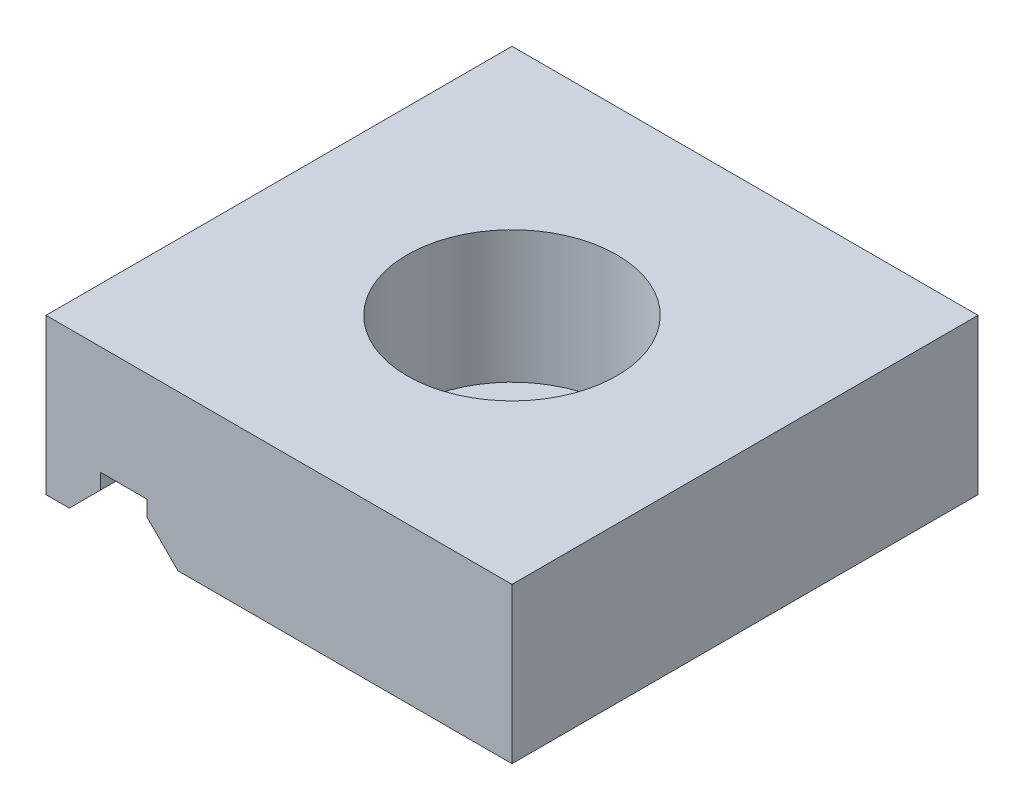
ISO-10303-21;
HEADER;
FILE_DESCRIPTION(('STEP AP214'),'2;1');
FILE_NAME('part.step','',(''),(''),'','','');
FILE_SCHEMA(('AUTOMOTIVE_DESIGN { 1 0 10303 214 1 1 1 1 }'));
ENDSEC;
DATA;
#1=APPLICATION_CONTEXT('core data for automotive mechanical design processes');
#2=APPLICATION_PROTOCOL_DEFINITION('international standard','automotive_design',2000,#1);
#3=PRODUCT_CONTEXT('',#1,'mechanical');
#4=PRODUCT('Part','Part','',(#3));
#5=PRODUCT_RELATED_PRODUCT_CATEGORY('part','',(#4));
#6=PRODUCT_DEFINITION_FORMATION('','',#4);
#7=PRODUCT_DEFINITION_CONTEXT('part definition',#1,'design');
#8=PRODUCT_DEFINITION('design','',#6,#7);
#9=PRODUCT_DEFINITION_SHAPE('','',#8);
#10=(LENGTH_UNIT() NAMED_UNIT(*) SI_UNIT(.MILLI.,.METRE.));
#11=(NAMED_UNIT(*) PLANE_ANGLE_UNIT() SI_UNIT($,.RADIAN.));
#12=(NAMED_UNIT(*) SI_UNIT($,.STERADIAN.) SOLID_ANGLE_UNIT());
#13=UNCERTAINTY_MEASURE_WITH_UNIT(LENGTH_MEASURE(1.E-05),#10,'distance_accuracy_value','');
#14=(GEOMETRIC_REPRESENTATION_CONTEXT(3) GLOBAL_UNCERTAINTY_ASSIGNED_CONTEXT((#13)) GLOBAL_UNIT_ASSIGNED_CONTEXT((#10,
#11,#12)) REPRESENTATION_CONTEXT('',''));
#15=CARTESIAN_POINT('',(0.,0.,0.));
#16=DIRECTION('',(0.,0.,1.));
#17=DIRECTION('',(1.,0.,0.));
#18=AXIS2_PLACEMENT_3D('',#15,#16,#17);
#19=CARTESIAN_POINT('',(15.,0.,-15.));
#20=DIRECTION('',(0.,-1.,0.));
#21=DIRECTION('',(0.,0.,-1.));
#22=AXIS2_PLACEMENT_3D('',#19,#20,#21);
#23=PLANE('',#22);
#24=CARTESIAN_POINT('',(0.,0.,0.));
#25=DIRECTION('',(0.,-1.,0.));
#26=DIRECTION('',(0.,0.,-1.));
#27=AXIS2_PLACEMENT_3D('',#24,#25,#26);
#28=CIRCLE('',#27,7.47725);
#29=CARTESIAN_POINT('',(-5.02275,0.,-5.53906580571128));
#30=VERTEX_POINT('',#29);
#31=CARTESIAN_POINT('',(-5.02275,0.,5.53906580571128));
#32=VERTEX_POINT('',#31);
#33=EDGE_CURVE('E201',#30,#32,#28,.T.);
#34=ORIENTED_EDGE('',*,*,#33,.F.);
#35=DIRECTION('',(0.,0.,1.));
#36=VECTOR('',#35,1.);
#37=CARTESIAN_POINT('',(-5.02275,0.,-15.));
#38=LINE('',#37,#36);
#39=EDGE_CURVE('E175',#30,#32,#38,.T.);
#40=ORIENTED_EDGE('',*,*,#39,.T.);
#41=EDGE_LOOP('',(#34,#40));
#42=FACE_BOUND('',#41,.T.);
#43=DIRECTION('',(0.,0.,1.));
#44=VECTOR('',#43,1.);
#45=CARTESIAN_POINT('',(-6.5,0.,-15.));
#46=LINE('',#45,#44);
#47=CARTESIAN_POINT('',(-6.5,0.,-15.));
#48=VERTEX_POINT('',#47);
#49=CARTESIAN_POINT('',(-6.5,0.,15.));
#50=VERTEX_POINT('',#49);
#51=EDGE_CURVE('E148',#48,#50,#46,.T.);
#52=ORIENTED_EDGE('',*,*,#51,.F.);
#53=DIRECTION('',(-1.,0.,0.));
#54=VECTOR('',#53,1.);
#55=CARTESIAN_POINT('',(-15.,0.,-15.));
#56=LINE('',#55,#54);
#57=CARTESIAN_POINT('',(15.,0.,-15.));
#58=VERTEX_POINT('',#57);
#59=EDGE_CURVE('E219',#58,#48,#56,.T.);
#60=ORIENTED_EDGE('',*,*,#59,.F.);
#61=DIRECTION('',(0.,0.,-1.));
#62=VECTOR('',#61,1.);
#63=CARTESIAN_POINT('',(15.,0.,15.));
#64=LINE('',#63,#62);
#65=CARTESIAN_POINT('',(15.,0.,15.));
#66=VERTEX_POINT('',#65);
#67=EDGE_CURVE('E205',#66,#58,#64,.T.);
#68=ORIENTED_EDGE('',*,*,#67,.F.);
#69=DIRECTION('',(1.,0.,0.));
#70=VECTOR('',#69,1.);
#71=CARTESIAN_POINT('',(-15.,0.,15.));
#72=LINE('',#71,#70);
#73=EDGE_CURVE('E77',#50,#66,#72,.T.);
#74=ORIENTED_EDGE('',*,*,#73,.F.);
#75=EDGE_LOOP('',(#52,#60,#68,#74));
#76=FACE_BOUND('',#75,.T.);
#77=ADVANCED_FACE('F33',(#42,#76),#23,.T.);
#78=DIRECTION('',(0.,0.,1.));
#79=VECTOR('',#78,1.);
#80=CARTESIAN_POINT('',(-13.5,0.,-15.));
#81=LINE('',#80,#79);
#82=CARTESIAN_POINT('',(-13.5,0.,-15.));
#83=VERTEX_POINT('',#82);
#84=CARTESIAN_POINT('',(-13.5,0.,15.));
#85=VERTEX_POINT('',#84);
#86=EDGE_CURVE('E178',#83,#85,#81,.T.);
#87=ORIENTED_EDGE('',*,*,#86,.T.);
#88=CARTESIAN_POINT('',(-15.,0.,15.));
#89=VERTEX_POINT('',#88);
#90=EDGE_CURVE('E210',#89,#85,#72,.T.);
#91=ORIENTED_EDGE('',*,*,#90,.F.);
#92=DIRECTION('',(0.,0.,1.));
#93=VECTOR('',#92,1.);
#94=CARTESIAN_POINT('',(-15.,0.,15.));
#95=LINE('',#94,#93);
#96=CARTESIAN_POINT('',(-15.,0.,-15.));
#97=VERTEX_POINT('',#96);
#98=EDGE_CURVE('E221',#97,#89,#95,.T.);
#99=ORIENTED_EDGE('',*,*,#98,.F.);
#100=EDGE_CURVE('E218',#83,#97,#56,.T.);
#101=ORIENTED_EDGE('',*,*,#100,.F.);
#102=EDGE_LOOP('',(#87,#91,#99,#101));
#103=FACE_BOUND('',#102,.T.);
#104=ADVANCED_FACE('F250',(#103),#23,.T.);
#105=CARTESIAN_POINT('',(15.,10.,15.));
#106=DIRECTION('',(-1.,0.,0.));
#107=DIRECTION('',(0.,0.,1.));
#108=AXIS2_PLACEMENT_3D('',#105,#106,#107);
#109=PLANE('',#108);
#110=ORIENTED_EDGE('',*,*,#67,.T.);
#111=DIRECTION('',(0.,-1.,0.));
#112=VECTOR('',#111,1.);
#113=CARTESIAN_POINT('',(15.,10.,-15.));
#114=LINE('',#113,#112);
#115=CARTESIAN_POINT('',(15.,10.,-15.));
#116=VERTEX_POINT('',#115);
#117=EDGE_CURVE('E41',#116,#58,#114,.T.);
#118=ORIENTED_EDGE('',*,*,#117,.F.);
#119=DIRECTION('',(0.,0.,-1.));
#120=VECTOR('',#119,1.);
#121=CARTESIAN_POINT('',(15.,10.,15.));
#122=LINE('',#121,#120);
#123=CARTESIAN_POINT('',(15.,10.,15.));
#124=VERTEX_POINT('',#123);
#125=EDGE_CURVE('E208',#124,#116,#122,.T.);
#126=ORIENTED_EDGE('',*,*,#125,.F.);
#127=DIRECTION('',(0.,-1.,0.));
#128=VECTOR('',#127,1.);
#129=CARTESIAN_POINT('',(15.,10.,15.));
#130=LINE('',#129,#128);
#131=EDGE_CURVE('E215',#124,#66,#130,.T.);
#132=ORIENTED_EDGE('',*,*,#131,.T.);
#133=EDGE_LOOP('',(#110,#118,#126,#132));
#134=FACE_BOUND('',#133,.T.);
#135=ADVANCED_FACE('F35',(#134),#109,.F.);
#136=CARTESIAN_POINT('',(-15.,10.,-15.));
#137=DIRECTION('',(0.,0.,1.));
#138=DIRECTION('',(1.,0.,0.));
#139=AXIS2_PLACEMENT_3D('',#136,#137,#138);
#140=PLANE('',#139);
#141=ORIENTED_EDGE('',*,*,#59,.T.);
#142=DIRECTION('',(-0.707106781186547,0.707106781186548,0.));
#143=VECTOR('',#142,1.);
#144=CARTESIAN_POINT('',(-6.5,0.,-15.));
#145=LINE('',#144,#143);
#146=CARTESIAN_POINT('',(-8.5,2.,-15.));
#147=VERTEX_POINT('',#146);
#148=EDGE_CURVE('E162',#48,#147,#145,.T.);
#149=ORIENTED_EDGE('',*,*,#148,.T.);
#150=DIRECTION('',(0.,1.,0.));
#151=VECTOR('',#150,1.);
#152=CARTESIAN_POINT('',(-8.5,2.,-15.));
#153=LINE('',#152,#151);
#154=CARTESIAN_POINT('',(-8.5,3.,-15.));
#155=VERTEX_POINT('',#154);
#156=EDGE_CURVE('E138',#147,#155,#153,.T.);
#157=ORIENTED_EDGE('',*,*,#156,.T.);
#158=DIRECTION('',(-1.,0.,0.));
#159=VECTOR('',#158,1.);
#160=CARTESIAN_POINT('',(-8.5,3.,-15.));
#161=LINE('',#160,#159);
#162=CARTESIAN_POINT('',(-11.5,3.,-15.));
#163=VERTEX_POINT('',#162);
#164=EDGE_CURVE('E165',#155,#163,#161,.T.);
#165=ORIENTED_EDGE('',*,*,#164,.T.);
#166=DIRECTION('',(0.,-1.,0.));
#167=VECTOR('',#166,1.);
#168=CARTESIAN_POINT('',(-11.5,2.,-15.));
#169=LINE('',#168,#167);
#170=CARTESIAN_POINT('',(-11.5,2.,-15.));
#171=VERTEX_POINT('',#170);
#172=EDGE_CURVE('E168',#163,#171,#169,.T.);
#173=ORIENTED_EDGE('',*,*,#172,.T.);
#174=DIRECTION('',(-0.707106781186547,-0.707106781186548,0.));
#175=VECTOR('',#174,1.);
#176=CARTESIAN_POINT('',(-13.5,0.,-15.));
#177=LINE('',#176,#175);
#178=EDGE_CURVE('E143',#171,#83,#177,.T.);
#179=ORIENTED_EDGE('',*,*,#178,.T.);
#180=ORIENTED_EDGE('',*,*,#100,.T.);
#181=DIRECTION('',(0.,-1.,0.));
#182=VECTOR('',#181,1.);
#183=CARTESIAN_POINT('',(-15.,10.,-15.));
#184=LINE('',#183,#182);
#185=CARTESIAN_POINT('',(-15.,10.,-15.));
#186=VERTEX_POINT('',#185);
#187=EDGE_CURVE('E229',#186,#97,#184,.T.);
#188=ORIENTED_EDGE('',*,*,#187,.F.);
#189=DIRECTION('',(-1.,0.,0.));
#190=VECTOR('',#189,1.);
#191=CARTESIAN_POINT('',(-15.,10.,-15.));
#192=LINE('',#191,#190);
#193=EDGE_CURVE('E85',#116,#186,#192,.T.);
#194=ORIENTED_EDGE('',*,*,#193,.F.);
#195=ORIENTED_EDGE('',*,*,#117,.T.);
#196=EDGE_LOOP('',(#141,#149,#157,#165,#173,#179,#180,#188,#194,#195));
#197=FACE_BOUND('',#196,.T.);
#198=ADVANCED_FACE('F232',(#197),#140,.F.);
#199=CARTESIAN_POINT('',(-15.,10.,15.));
#200=DIRECTION('',(1.,0.,0.));
#201=DIRECTION('',(0.,0.,-1.));
#202=AXIS2_PLACEMENT_3D('',#199,#200,#201);
#203=PLANE('',#202);
#204=ORIENTED_EDGE('',*,*,#98,.T.);
#205=DIRECTION('',(0.,-1.,0.));
#206=VECTOR('',#205,1.);
#207=CARTESIAN_POINT('',(-15.,10.,15.));
#208=LINE('',#207,#206);
#209=CARTESIAN_POINT('',(-15.,10.,15.));
#210=VERTEX_POINT('',#209);
#211=EDGE_CURVE('E226',#210,#89,#208,.T.);
#212=ORIENTED_EDGE('',*,*,#211,.F.);
#213=DIRECTION('',(0.,0.,1.));
#214=VECTOR('',#213,1.);
#215=CARTESIAN_POINT('',(-15.,10.,15.));
#216=LINE('',#215,#214);
#217=EDGE_CURVE('E212',#186,#210,#216,.T.);
#218=ORIENTED_EDGE('',*,*,#217,.F.);
#219=ORIENTED_EDGE('',*,*,#187,.T.);
#220=EDGE_LOOP('',(#204,#212,#218,#219));
#221=FACE_BOUND('',#220,.T.);
#222=ADVANCED_FACE('F254',(#221),#203,.F.);
#223=CARTESIAN_POINT('',(-15.,10.,15.));
#224=DIRECTION('',(0.,0.,-1.));
#225=DIRECTION('',(-1.,0.,0.));
#226=AXIS2_PLACEMENT_3D('',#223,#224,#225);
#227=PLANE('',#226);
#228=DIRECTION('',(0.,1.,0.));
#229=VECTOR('',#228,1.);
#230=CARTESIAN_POINT('',(-8.5,2.,15.));
#231=LINE('',#230,#229);
#232=CARTESIAN_POINT('',(-8.5,2.,15.));
#233=VERTEX_POINT('',#232);
#234=CARTESIAN_POINT('',(-8.5,3.,15.));
#235=VERTEX_POINT('',#234);
#236=EDGE_CURVE('E135',#233,#235,#231,.T.);
#237=ORIENTED_EDGE('',*,*,#236,.F.);
#238=DIRECTION('',(-0.707106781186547,0.707106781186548,0.));
#239=VECTOR('',#238,1.);
#240=CARTESIAN_POINT('',(-6.5,0.,15.));
#241=LINE('',#240,#239);
#242=EDGE_CURVE('E145',#50,#233,#241,.T.);
#243=ORIENTED_EDGE('',*,*,#242,.F.);
#244=ORIENTED_EDGE('',*,*,#73,.T.);
#245=ORIENTED_EDGE('',*,*,#131,.F.);
#246=DIRECTION('',(1.,0.,0.));
#247=VECTOR('',#246,1.);
#248=CARTESIAN_POINT('',(-15.,10.,15.));
#249=LINE('',#248,#247);
#250=EDGE_CURVE('E56',#210,#124,#249,.T.);
#251=ORIENTED_EDGE('',*,*,#250,.F.);
#252=ORIENTED_EDGE('',*,*,#211,.T.);
#253=ORIENTED_EDGE('',*,*,#90,.T.);
#254=DIRECTION('',(-0.707106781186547,-0.707106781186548,0.));
#255=VECTOR('',#254,1.);
#256=CARTESIAN_POINT('',(-13.5,0.,15.));
#257=LINE('',#256,#255);
#258=CARTESIAN_POINT('',(-11.5,2.,15.));
#259=VERTEX_POINT('',#258);
#260=EDGE_CURVE('E160',#259,#85,#257,.T.);
#261=ORIENTED_EDGE('',*,*,#260,.F.);
#262=DIRECTION('',(0.,-1.,0.));
#263=VECTOR('',#262,1.);
#264=CARTESIAN_POINT('',(-11.5,2.,15.));
#265=LINE('',#264,#263);
#266=CARTESIAN_POINT('',(-11.5,3.,15.));
#267=VERTEX_POINT('',#266);
#268=EDGE_CURVE('E155',#267,#259,#265,.T.);
#269=ORIENTED_EDGE('',*,*,#268,.F.);
#270=DIRECTION('',(-1.,0.,0.));
#271=VECTOR('',#270,1.);
#272=CARTESIAN_POINT('',(-8.5,3.,15.));
#273=LINE('',#272,#271);
#274=EDGE_CURVE('E153',#235,#267,#273,.T.);
#275=ORIENTED_EDGE('',*,*,#274,.F.);
#276=EDGE_LOOP('',(#237,#243,#244,#245,#251,#252,#253,#261,#269,#275));
#277=FACE_BOUND('',#276,.T.);
#278=ADVANCED_FACE('F150',(#277),#227,.F.);
#279=CARTESIAN_POINT('',(15.,10.,-15.));
#280=DIRECTION('',(0.,-1.,0.));
#281=DIRECTION('',(0.,0.,-1.));
#282=AXIS2_PLACEMENT_3D('',#279,#280,#281);
#283=PLANE('',#282);
#284=CARTESIAN_POINT('',(0.,10.,0.));
#285=DIRECTION('',(0.,1.,0.));
#286=DIRECTION('',(0.,0.,1.));
#287=AXIS2_PLACEMENT_3D('',#284,#285,#286);
#288=CIRCLE('',#287,6.75);
#289=CARTESIAN_POINT('',(0.,10.,6.75));
#290=VERTEX_POINT('',#289);
#291=EDGE_CURVE('E189',#290,#290,#288,.T.);
#292=ORIENTED_EDGE('',*,*,#291,.F.);
#293=EDGE_LOOP('',(#292));
#294=FACE_BOUND('',#293,.T.);
#295=ORIENTED_EDGE('',*,*,#125,.T.);
#296=ORIENTED_EDGE('',*,*,#193,.T.);
#297=ORIENTED_EDGE('',*,*,#217,.T.);
#298=ORIENTED_EDGE('',*,*,#250,.T.);
#299=EDGE_LOOP('',(#295,#296,#297,#298));
#300=FACE_BOUND('',#299,.T.);
#301=ADVANCED_FACE('F256',(#294,#300),#283,.F.);
#302=CARTESIAN_POINT('',(0.,-3.,0.));
#303=DIRECTION('',(0.,1.,0.));
#304=DIRECTION('',(0.,0.,1.));
#305=AXIS2_PLACEMENT_3D('',#302,#303,#304);
#306=CYLINDRICAL_SURFACE('',#305,7.47725);
#307=CARTESIAN_POINT('',(0.,-3.,0.));
#308=DIRECTION('',(0.,-1.,0.));
#309=DIRECTION('',(0.,0.,-1.));
#310=AXIS2_PLACEMENT_3D('',#307,#308,#309);
#311=CIRCLE('',#310,7.47725);
#312=CARTESIAN_POINT('',(-5.02275,-3.,-5.53906580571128));
#313=VERTEX_POINT('',#312);
#314=CARTESIAN_POINT('',(-5.02275,-3.,5.53906580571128));
#315=VERTEX_POINT('',#314);
#316=EDGE_CURVE('E202',#313,#315,#311,.T.);
#317=ORIENTED_EDGE('',*,*,#316,.F.);
#318=DIRECTION('',(0.,1.,0.));
#319=VECTOR('',#318,1.);
#320=CARTESIAN_POINT('',(-5.02275,-3.,-5.53906580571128));
#321=LINE('',#320,#319);
#322=EDGE_CURVE('E47',#313,#30,#321,.T.);
#323=ORIENTED_EDGE('',*,*,#322,.T.);
#324=ORIENTED_EDGE('',*,*,#33,.T.);
#325=DIRECTION('',(0.,1.,0.));
#326=VECTOR('',#325,1.);
#327=CARTESIAN_POINT('',(-5.02275,-3.,5.53906580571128));
#328=LINE('',#327,#326);
#329=EDGE_CURVE('E174',#32,#315,#328,.F.);
#330=ORIENTED_EDGE('',*,*,#329,.T.);
#331=EDGE_LOOP('',(#317,#323,#324,#330));
#332=FACE_BOUND('',#331,.T.);
#333=ADVANCED_FACE('F258',(#332),#306,.T.);
#334=CARTESIAN_POINT('',(0.,-3.,0.));
#335=DIRECTION('',(0.,-1.,0.));
#336=DIRECTION('',(0.,0.,-1.));
#337=AXIS2_PLACEMENT_3D('',#334,#335,#336);
#338=PLANE('',#337);
#339=DIRECTION('',(0.,0.,1.));
#340=VECTOR('',#339,1.);
#341=CARTESIAN_POINT('',(-5.02275,-3.,0.));
#342=LINE('',#341,#340);
#343=EDGE_CURVE('E11',#313,#315,#342,.T.);
#344=ORIENTED_EDGE('',*,*,#343,.F.);
#345=ORIENTED_EDGE('',*,*,#316,.T.);
#346=EDGE_LOOP('',(#344,#345));
#347=FACE_BOUND('',#346,.T.);
#348=CARTESIAN_POINT('',(0.,-3.,0.));
#349=DIRECTION('',(0.,1.,0.));
#350=DIRECTION('',(0.,0.,1.));
#351=AXIS2_PLACEMENT_3D('',#348,#349,#350);
#352=CIRCLE('',#351,4.25);
#353=CARTESIAN_POINT('',(0.,-3.,4.25));
#354=VERTEX_POINT('',#353);
#355=EDGE_CURVE('E198',#354,#354,#352,.T.);
#356=ORIENTED_EDGE('',*,*,#355,.T.);
#357=EDGE_LOOP('',(#356));
#358=FACE_BOUND('',#357,.T.);
#359=ADVANCED_FACE('F265',(#347,#358),#338,.T.);
#360=CARTESIAN_POINT('',(0.,10.,0.));
#361=DIRECTION('',(0.,1.,0.));
#362=DIRECTION('',(0.,0.,1.));
#363=AXIS2_PLACEMENT_3D('',#360,#361,#362);
#364=CYLINDRICAL_SURFACE('',#363,4.25);
#365=ORIENTED_EDGE('',*,*,#355,.F.);
#366=EDGE_LOOP('',(#365));
#367=FACE_BOUND('',#366,.T.);
#368=CARTESIAN_POINT('',(0.,1.5,0.));
#369=DIRECTION('',(0.,1.,0.));
#370=DIRECTION('',(0.,0.,1.));
#371=AXIS2_PLACEMENT_3D('',#368,#369,#370);
#372=CIRCLE('',#371,4.25);
#373=CARTESIAN_POINT('',(0.,1.5,4.25));
#374=VERTEX_POINT('',#373);
#375=EDGE_CURVE('E195',#374,#374,#372,.T.);
#376=ORIENTED_EDGE('',*,*,#375,.T.);
#377=EDGE_LOOP('',(#376));
#378=FACE_BOUND('',#377,.T.);
#379=ADVANCED_FACE('F320',(#367,#378),#364,.F.);
#380=CARTESIAN_POINT('',(4.25,1.5,0.));
#381=DIRECTION('',(0.,-1.,0.));
#382=DIRECTION('',(0.,0.,-1.));
#383=AXIS2_PLACEMENT_3D('',#380,#381,#382);
#384=PLANE('',#383);
#385=ORIENTED_EDGE('',*,*,#375,.F.);
#386=EDGE_LOOP('',(#385));
#387=FACE_BOUND('',#386,.T.);
#388=CARTESIAN_POINT('',(0.,1.5,0.));
#389=DIRECTION('',(0.,1.,0.));
#390=DIRECTION('',(0.,0.,1.));
#391=AXIS2_PLACEMENT_3D('',#388,#389,#390);
#392=CIRCLE('',#391,6.75);
#393=CARTESIAN_POINT('',(0.,1.5,6.75));
#394=VERTEX_POINT('',#393);
#395=EDGE_CURVE('E192',#394,#394,#392,.T.);
#396=ORIENTED_EDGE('',*,*,#395,.T.);
#397=EDGE_LOOP('',(#396));
#398=FACE_BOUND('',#397,.T.);
#399=ADVANCED_FACE('F380',(#387,#398),#384,.F.);
#400=CARTESIAN_POINT('',(0.,10.,0.));
#401=DIRECTION('',(0.,1.,0.));
#402=DIRECTION('',(0.,0.,1.));
#403=AXIS2_PLACEMENT_3D('',#400,#401,#402);
#404=CYLINDRICAL_SURFACE('',#403,6.75);
#405=ORIENTED_EDGE('',*,*,#395,.F.);
#406=EDGE_LOOP('',(#405));
#407=FACE_BOUND('',#406,.T.);
#408=ORIENTED_EDGE('',*,*,#291,.T.);
#409=EDGE_LOOP('',(#408));
#410=FACE_BOUND('',#409,.T.);
#411=ADVANCED_FACE('F333',(#407,#410),#404,.F.);
#412=CARTESIAN_POINT('',(-5.02275,0.,-15.));
#413=DIRECTION('',(1.,0.,0.));
#414=DIRECTION('',(0.,0.,-1.));
#415=AXIS2_PLACEMENT_3D('',#412,#413,#414);
#416=PLANE('',#415);
#417=ORIENTED_EDGE('',*,*,#343,.T.);
#418=ORIENTED_EDGE('',*,*,#329,.F.);
#419=ORIENTED_EDGE('',*,*,#39,.F.);
#420=ORIENTED_EDGE('',*,*,#322,.F.);
#421=EDGE_LOOP('',(#417,#418,#419,#420));
#422=FACE_BOUND('',#421,.T.);
#423=ADVANCED_FACE('F328',(#422),#416,.F.);
#424=CARTESIAN_POINT('',(-6.5,0.,-15.));
#425=DIRECTION('',(0.707106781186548,0.707106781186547,0.));
#426=DIRECTION('',(-0.707106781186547,0.707106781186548,0.));
#427=AXIS2_PLACEMENT_3D('',#424,#425,#426);
#428=PLANE('',#427);
#429=DIRECTION('',(0.,0.,1.));
#430=VECTOR('',#429,1.);
#431=CARTESIAN_POINT('',(-8.5,2.,-15.));
#432=LINE('',#431,#430);
#433=EDGE_CURVE('E131',#147,#233,#432,.T.);
#434=ORIENTED_EDGE('',*,*,#433,.F.);
#435=ORIENTED_EDGE('',*,*,#148,.F.);
#436=ORIENTED_EDGE('',*,*,#51,.T.);
#437=ORIENTED_EDGE('',*,*,#242,.T.);
#438=EDGE_LOOP('',(#434,#435,#436,#437));
#439=FACE_BOUND('',#438,.T.);
#440=ADVANCED_FACE('F146',(#439),#428,.F.);
#441=CARTESIAN_POINT('',(-13.5,0.,-15.));
#442=DIRECTION('',(-0.707106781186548,0.707106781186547,0.));
#443=DIRECTION('',(-0.707106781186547,-0.707106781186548,0.));
#444=AXIS2_PLACEMENT_3D('',#441,#442,#443);
#445=PLANE('',#444);
#446=ORIENTED_EDGE('',*,*,#86,.F.);
#447=ORIENTED_EDGE('',*,*,#178,.F.);
#448=DIRECTION('',(0.,0.,1.));
#449=VECTOR('',#448,1.);
#450=CARTESIAN_POINT('',(-11.5,2.,-15.));
#451=LINE('',#450,#449);
#452=EDGE_CURVE('E181',#171,#259,#451,.T.);
#453=ORIENTED_EDGE('',*,*,#452,.T.);
#454=ORIENTED_EDGE('',*,*,#260,.T.);
#455=EDGE_LOOP('',(#446,#447,#453,#454));
#456=FACE_BOUND('',#455,.T.);
#457=ADVANCED_FACE('F246',(#456),#445,.F.);
#458=CARTESIAN_POINT('',(-11.5,2.,-15.));
#459=DIRECTION('',(-1.,0.,0.));
#460=DIRECTION('',(0.,0.,1.));
#461=AXIS2_PLACEMENT_3D('',#458,#459,#460);
#462=PLANE('',#461);
#463=ORIENTED_EDGE('',*,*,#452,.F.);
#464=ORIENTED_EDGE('',*,*,#172,.F.);
#465=DIRECTION('',(0.,0.,1.));
#466=VECTOR('',#465,1.);
#467=CARTESIAN_POINT('',(-11.5,3.,-15.));
#468=LINE('',#467,#466);
#469=EDGE_CURVE('E183',#163,#267,#468,.T.);
#470=ORIENTED_EDGE('',*,*,#469,.T.);
#471=ORIENTED_EDGE('',*,*,#268,.T.);
#472=EDGE_LOOP('',(#463,#464,#470,#471));
#473=FACE_BOUND('',#472,.T.);
#474=ADVANCED_FACE('F242',(#473),#462,.F.);
#475=CARTESIAN_POINT('',(-8.5,3.,-15.));
#476=DIRECTION('',(0.,1.,0.));
#477=DIRECTION('',(0.,0.,1.));
#478=AXIS2_PLACEMENT_3D('',#475,#476,#477);
#479=PLANE('',#478);
#480=ORIENTED_EDGE('',*,*,#469,.F.);
#481=ORIENTED_EDGE('',*,*,#164,.F.);
#482=DIRECTION('',(0.,0.,1.));
#483=VECTOR('',#482,1.);
#484=CARTESIAN_POINT('',(-8.5,3.,-15.));
#485=LINE('',#484,#483);
#486=EDGE_CURVE('E142',#155,#235,#485,.T.);
#487=ORIENTED_EDGE('',*,*,#486,.T.);
#488=ORIENTED_EDGE('',*,*,#274,.T.);
#489=EDGE_LOOP('',(#480,#481,#487,#488));
#490=FACE_BOUND('',#489,.T.);
#491=ADVANCED_FACE('F240',(#490),#479,.F.);
#492=CARTESIAN_POINT('',(-8.5,2.,-15.));
#493=DIRECTION('',(1.,0.,0.));
#494=DIRECTION('',(0.,0.,-1.));
#495=AXIS2_PLACEMENT_3D('',#492,#493,#494);
#496=PLANE('',#495);
#497=ORIENTED_EDGE('',*,*,#486,.F.);
#498=ORIENTED_EDGE('',*,*,#156,.F.);
#499=ORIENTED_EDGE('',*,*,#433,.T.);
#500=ORIENTED_EDGE('',*,*,#236,.T.);
#501=EDGE_LOOP('',(#497,#498,#499,#500));
#502=FACE_BOUND('',#501,.T.);
#503=ADVANCED_FACE('F133',(#502),#496,.F.);
#504=CLOSED_SHELL('',(#77,#104,#135,#198,#222,#278,#301,#333,#359,#379,#399,#411,#423,#440,#457,
#474,#491,#503));
#505=MANIFOLD_SOLID_BREP('B2',#504);
#506=ADVANCED_BREP_SHAPE_REPRESENTATION('',(#18,#505),#14);
#507=SHAPE_DEFINITION_REPRESENTATION(#9,#506);
ENDSEC;
END-ISO-10303-21;
